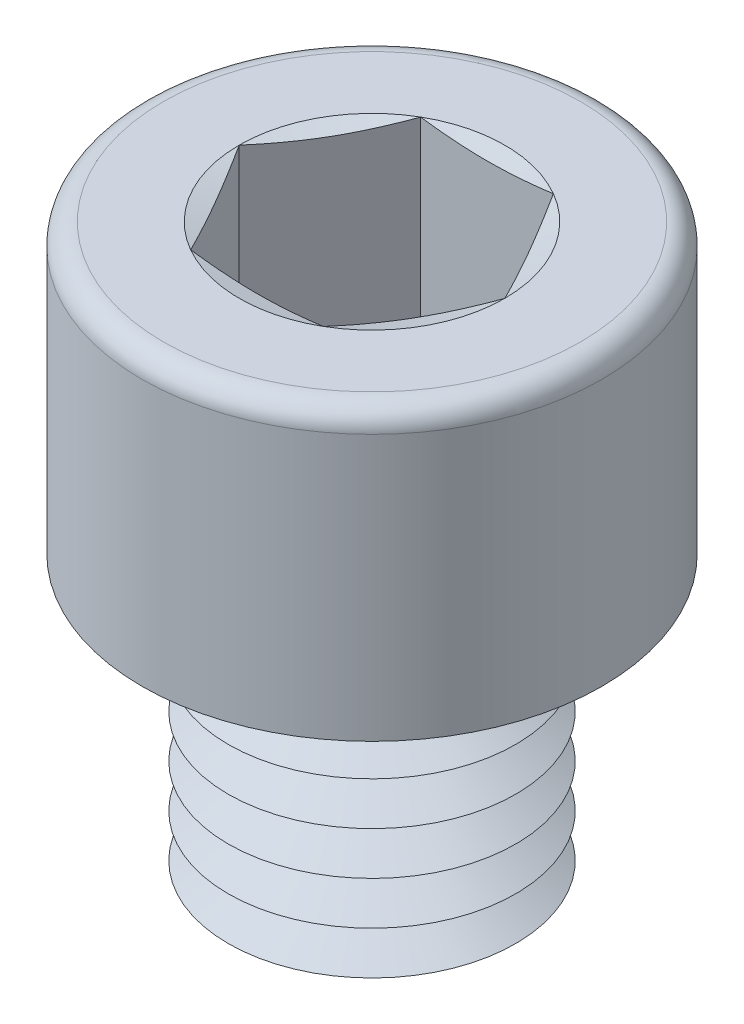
from build123d import *

# Parameters (mm, degrees)
SKETCH1_R       = 5
EXTRUDE1_DEPTH  = 10
SKETCH2_R       = 8
EXTRUDE2_DEPTH  = 10
EXTRUDE3_DEPTH  = 8
FILLET1_R       = 0.75
LPATTERN1_COUNT = 7
LPATTERN1_PITCH = 1.5


with BuildPart() as part:
    # Sketch1 → Extrude1 (new body)
    with BuildSketch(Plane(origin=(0, 0, 0), x_dir=(1, 0, 0), z_dir=(0, 1, 0))):
        with Locations(Location((0, 0, 0), (0, 0, 270))):
            Circle(SKETCH1_R)
    extrude(amount=EXTRUDE1_DEPTH)

    # Sketch2 → Extrude2 (add)
    with BuildSketch(Plane(origin=(0, 10, 0), x_dir=(1, 0, 0), z_dir=(0, 1, 0))):
        with Locations(Location((0, 0, 0), (0, 0, 270))):
            Circle(SKETCH2_R)
    extrude(amount=EXTRUDE2_DEPTH)

    # Sketch3 → Extrude3 (cut)
    with BuildSketch(Plane(origin=(0, 20, 0), x_dir=(1, 0, 0), z_dir=(0, 1, 0))):
        Polygon((2.309401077, 4), (-2.309401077, 4), (-4.618802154, 0), (-2.309401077, -4), (2.309401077, -4), (4.618802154, 0), align=None)
    extrude(amount=-EXTRUDE3_DEPTH, mode=Mode.SUBTRACT)

    # Fillet1
    fillet1_edges = [part.edges().sort_by_distance(p)[0] for p in [
        (0, 20, -8),
    ]]
    fillet(fillet1_edges, radius=FILLET1_R)

    # Sketch4 → Cut-Revolve1 (revolve, cut)
    with BuildSketch(Plane(origin=(0, 0, 0), x_dir=(0, 0, -1), z_dir=(1, 0, 0))):
        Polygon((-4, 12), (0, 12), (0, 9.690598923), align=None)
    revolve(axis=Axis((0, 12, 0), (0, -1, 0)), mode=Mode.SUBTRACT)

    # Sketch5 → Cut-Revolve2 (revolve, cut)
    with BuildSketch(Plane.XY, mode=Mode.PRIVATE) as cut_revolve2_sk:
        Polygon((-5, 0.75), (-5, -0.75), (-3.700961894, 0), align=None)
    cut_revolve2 = revolve(cut_revolve2_sk.sketch.rotate(Axis((0, 10, 0), (0, -1, 0)), 270), axis=Axis((0, 10, 0), (0, -1, 0)), mode=Mode.SUBTRACT)

    # LPattern1: Cut-Revolve2 ×7
    with Locations(*[(0, i * LPATTERN1_PITCH, 0) for i in range(1, LPATTERN1_COUNT)]):
        add(cut_revolve2, mode=Mode.SUBTRACT)

    # Extrude4 cone 1 section (on through the dimple's axis) → Extrude4 (revolve, cut)
    with BuildSketch(Plane(origin=(0, 20, 0), x_dir=(0, 0, 1), z_dir=(1, 0, 0))):
        Polygon((0, 0), (4.618802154, 0), (0, 1.237604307), align=None)
    revolve(axis=Axis((0, 20, 0), (0, -1, 0)), mode=Mode.SUBTRACT)


solid = part.part
